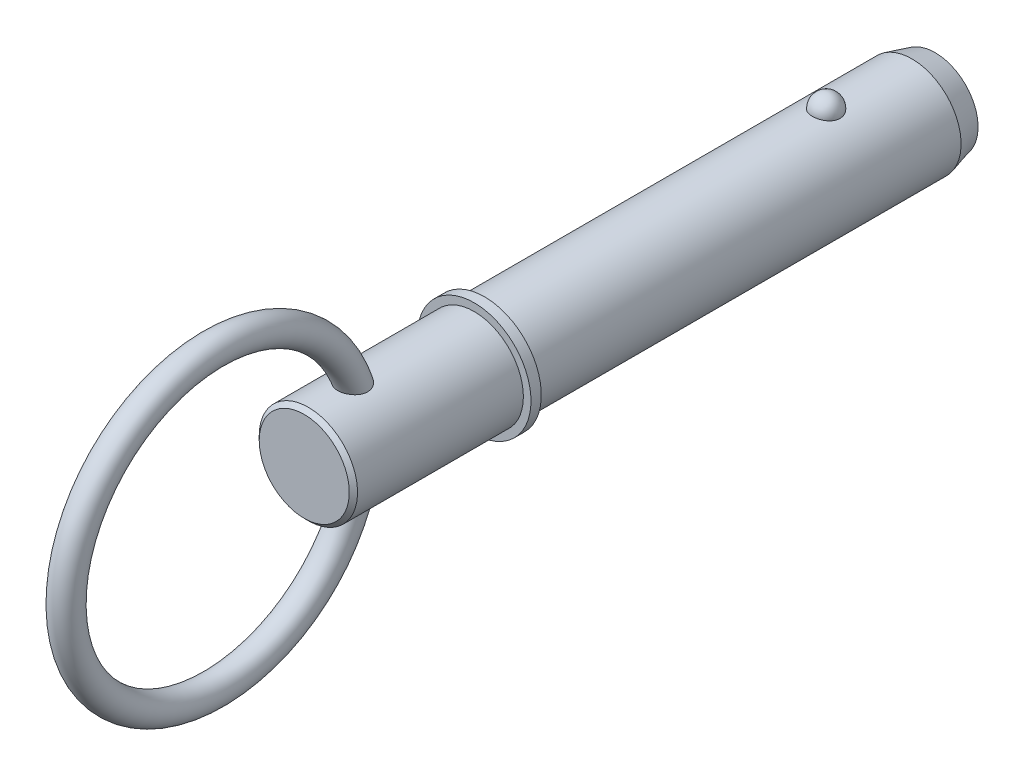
from build123d import *

# Parameters (mm, degrees)
SKETCH2_R           = 9.525
BOSS_EXTRUDE1_DEPTH = 63.5
BOSS_EXTRUDE2_START = 23.8
SKETCH3_R           = 9.525
BOSS_EXTRUDE2_DEPTH = 23.8
CHAMFER1_SIZE       = 4.5
CHAMFER1_SIZE2      = 1.205771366
SKETCH20_W          = 2
SKETCH20_H          = 11
SKETCH21_R          = 9.525
BOSS_EXTRUDE3_DEPTH = 34.93
CHAMFER2_SIZE       = 0.8
SKETCH24_R          = 2.75


with BuildPart() as part:
    # Sketch2 → Boss-Extrude1 (new body)
    with BuildSketch(Plane.XY):
        Circle(SKETCH2_R)
    extrude(amount=BOSS_EXTRUDE1_DEPTH)

    # Sketch3 → Boss-Extrude2 (add)
    with BuildSketch(Plane(origin=(0, 0, 0), x_dir=(-1, 0, 0), z_dir=(0, 0, -1)).offset(BOSS_EXTRUDE2_START)):
        Circle(SKETCH3_R)
    extrude(amount=-BOSS_EXTRUDE2_DEPTH)

    # Chamfer1
    chamfer1_edges = [part.edges().sort_by_distance(p)[0] for p in [
        (9.525, 0, -23.8),
    ]]
    chamfer1_side = [part.faces().sort_by_distance(p)[0] for p in [
        (9.525, 0, -11.9),
    ]]
    chamfer(chamfer1_edges, length=CHAMFER1_SIZE, length2=CHAMFER1_SIZE2, reference=chamfer1_side[0])

    # Sketch18 → Revolve1 (revolve)
    with BuildSketch(Plane(origin=(0, 0, 0), x_dir=(0, 0, -1), z_dir=(1, 0, 0))):
        with BuildLine():
            Line((2.69, 12.215), (2.69, 6.835))
            ThreePointArc((2.69, 6.835), (0, 9.525), (2.69, 12.215))
        make_face()
    revolve(axis=Axis((0, 12.215, -2.69), (0, -1, 0)))

    # Sketch20 → Revolve2 (revolve)
    with BuildSketch(Plane(origin=(0, 0, 0), x_dir=(0, 0, -1), z_dir=(1, 0, 0)), mode=Mode.PRIVATE) as revolve2_sk:
        with Locations((-64.5, 5.5)):
            Rectangle(SKETCH20_W, SKETCH20_H)
    revolve(revolve2_sk.sketch.rotate(Axis((0, 0, 33.728787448), (0, 0, 1)), 90), axis=Axis((0, 0, 33.728787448), (0, 0, 1)))

    # Sketch21 → Boss-Extrude3 (add)
    with BuildSketch(Plane(origin=(0, 0, 63.5), x_dir=(-1, 0, 0), z_dir=(0, 0, -1))):
        Circle(SKETCH21_R)
    extrude(amount=-BOSS_EXTRUDE3_DEPTH)

    # Chamfer2
    chamfer2_edges = [part.edges().sort_by_distance(p)[0] for p in [
        (9.525, 0, 98.43),
    ]]
    chamfer(chamfer2_edges, length=CHAMFER2_SIZE)

    # Sweep1: sweep along a path in Sketch23
    with BuildLine(Plane(origin=(0, 0, 0), x_dir=(0, 0, -1), z_dir=(1, 0, 0))) as sweep1_path:
        CenterArc((-116.005, 0), 28.575, 0, 360)
    # Sketch24 → Sweep1 (sweep)
    with BuildSketch(Plane(origin=(0, 0, 0), x_dir=(1, 0, 0), z_dir=(0, 1, 0))):
        with Locations((0, -87.43)):
            Circle(SKETCH24_R)
    sweep(path=sweep1_path.line)


solid = part.part
